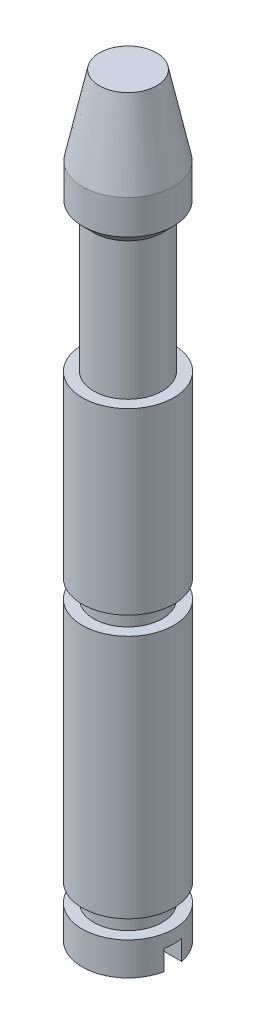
from build123d import *

# Parameters (mm, degrees)
SKETCH2_W       = 6.35
SKETCH2_H       = 1.2192
EXTRUDE1_DEPTH  = 1.397
SKETCH3_W       = 0.79375
SKETCH3_H       = 1.27
LPATTERN2_COUNT = 2
LPATTERN2_PITCH = 18.25625


with BuildPart() as part:
    # Sketch1 → Revolve1 (revolve)
    with BuildSketch(Plane.XY, mode=Mode.PRIVATE) as revolve1_sk:
        Polygon((0, 52.3875), (1.984375, 52.3875), (3.1496, 46.905547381), (3.1496, 44.524297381), (2.38125, 43.755947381), (2.38125, 34.230947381), (3.175, 34.230947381), (3.175, 0), (0, 0), align=None)
    revolve(revolve1_sk.sketch.rotate(Axis((0, 52.3875, 0), (0, 1, 0)), 90), axis=Axis((0, 52.3875, 0), (0, 1, 0)))

    # Sketch2 → Extrude1 (cut)
    with BuildSketch(Plane.XZ):
        Rectangle(SKETCH2_W, SKETCH2_H)
    extrude(amount=-EXTRUDE1_DEPTH, mode=Mode.SUBTRACT)

    # Sketch3 → Cut-Revolve1 (revolve, cut)
    with BuildSketch(Plane.XY, mode=Mode.PRIVATE) as cut_revolve1_sk:
        with Locations((2.778125, 2.921)):
            Rectangle(SKETCH3_W, SKETCH3_H)
    cut_revolve1 = revolve(cut_revolve1_sk.sketch.rotate(Axis((0, 0, 0), (0, 1, 0)), 90), axis=Axis((0, 0, 0), (0, 1, 0)), mode=Mode.SUBTRACT)

    # LPattern2: Cut-Revolve1 ×2
    with Locations(*[(0, i * LPATTERN2_PITCH, 0) for i in range(1, LPATTERN2_COUNT)]):
        add(cut_revolve1, mode=Mode.SUBTRACT)


solid = part.part
